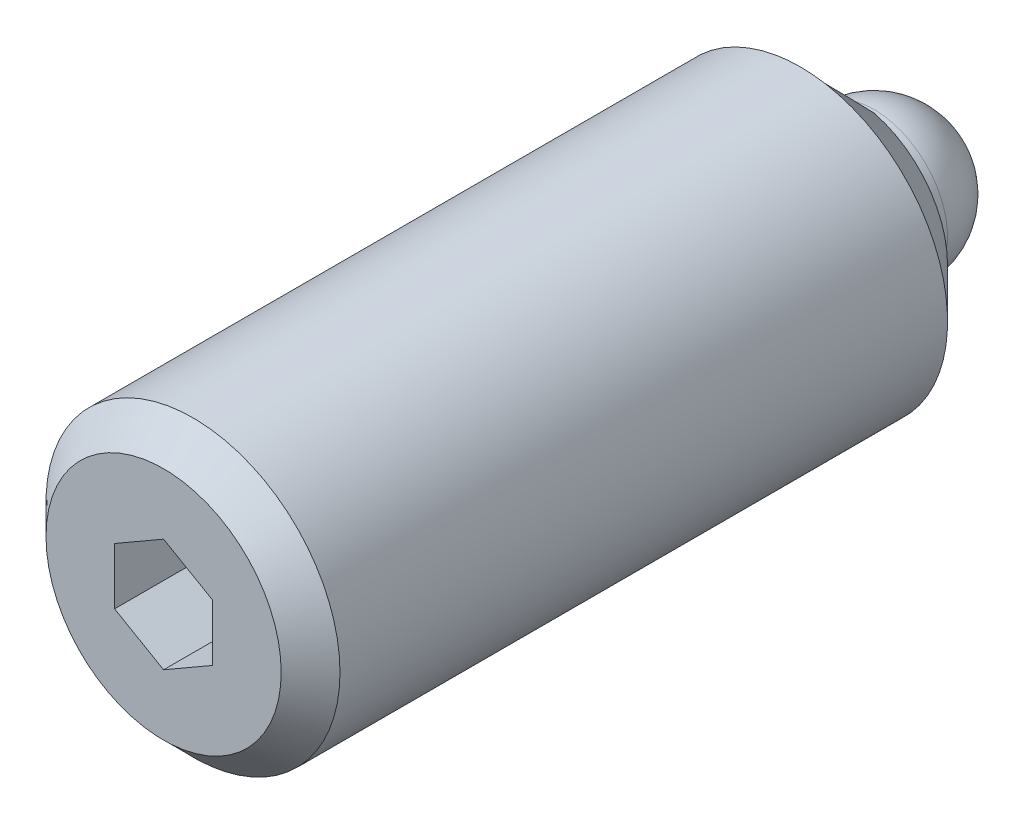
ISO-10303-21;
HEADER;
FILE_DESCRIPTION(('STEP AP214'),'2;1');
FILE_NAME('part.step','',(''),(''),'','','');
FILE_SCHEMA(('AUTOMOTIVE_DESIGN { 1 0 10303 214 1 1 1 1 }'));
ENDSEC;
DATA;
#1=APPLICATION_CONTEXT('core data for automotive mechanical design processes');
#2=APPLICATION_PROTOCOL_DEFINITION('international standard','automotive_design',2000,#1);
#3=PRODUCT_CONTEXT('',#1,'mechanical');
#4=PRODUCT('Part','Part','',(#3));
#5=PRODUCT_RELATED_PRODUCT_CATEGORY('part','',(#4));
#6=PRODUCT_DEFINITION_FORMATION('','',#4);
#7=PRODUCT_DEFINITION_CONTEXT('part definition',#1,'design');
#8=PRODUCT_DEFINITION('design','',#6,#7);
#9=PRODUCT_DEFINITION_SHAPE('','',#8);
#10=(LENGTH_UNIT() NAMED_UNIT(*) SI_UNIT(.MILLI.,.METRE.));
#11=(NAMED_UNIT(*) PLANE_ANGLE_UNIT() SI_UNIT($,.RADIAN.));
#12=(NAMED_UNIT(*) SI_UNIT($,.STERADIAN.) SOLID_ANGLE_UNIT());
#13=UNCERTAINTY_MEASURE_WITH_UNIT(LENGTH_MEASURE(1.E-05),#10,'distance_accuracy_value','');
#14=(GEOMETRIC_REPRESENTATION_CONTEXT(3) GLOBAL_UNCERTAINTY_ASSIGNED_CONTEXT((#13)) GLOBAL_UNIT_ASSIGNED_CONTEXT((#10,
#11,#12)) REPRESENTATION_CONTEXT('',''));
#15=CARTESIAN_POINT('',(0.,0.,0.));
#16=DIRECTION('',(0.,0.,1.));
#17=DIRECTION('',(1.,0.,0.));
#18=AXIS2_PLACEMENT_3D('',#15,#16,#17);
#19=CARTESIAN_POINT('',(0.,3.,4.));
#20=DIRECTION('',(0.,0.,-1.));
#21=DIRECTION('',(-1.,0.,0.));
#22=AXIS2_PLACEMENT_3D('',#19,#20,#21);
#23=PLANE('',#22);
#24=DIRECTION('',(0.,-1.,0.));
#25=VECTOR('',#24,1.);
#26=CARTESIAN_POINT('',(1.,-2.82842712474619,4.));
#27=LINE('',#26,#25);
#28=CARTESIAN_POINT('',(1.,-2.82842712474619,4.));
#29=VERTEX_POINT('',#28);
#30=CARTESIAN_POINT('',(1.,-3.87298334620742,4.));
#31=VERTEX_POINT('',#30);
#32=EDGE_CURVE('E130',#29,#31,#27,.T.);
#33=ORIENTED_EDGE('',*,*,#32,.F.);
#34=CARTESIAN_POINT('',(0.,0.,4.));
#35=DIRECTION('',(0.,0.,-1.));
#36=DIRECTION('',(-1.,0.,0.));
#37=AXIS2_PLACEMENT_3D('',#34,#35,#36);
#38=CIRCLE('',#37,3.);
#39=CARTESIAN_POINT('',(1.,2.82842712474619,4.));
#40=VERTEX_POINT('',#39);
#41=EDGE_CURVE('E219',#40,#29,#38,.T.);
#42=ORIENTED_EDGE('',*,*,#41,.F.);
#43=DIRECTION('',(0.,-1.,0.));
#44=VECTOR('',#43,1.);
#45=CARTESIAN_POINT('',(1.,6.70307128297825,4.));
#46=LINE('',#45,#44);
#47=CARTESIAN_POINT('',(1.,3.87298334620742,4.));
#48=VERTEX_POINT('',#47);
#49=EDGE_CURVE('E149',#48,#40,#46,.T.);
#50=ORIENTED_EDGE('',*,*,#49,.F.);
#51=CARTESIAN_POINT('',(0.,0.,4.));
#52=DIRECTION('',(0.,0.,-1.));
#53=DIRECTION('',(-1.,0.,0.));
#54=AXIS2_PLACEMENT_3D('',#51,#52,#53);
#55=CIRCLE('',#54,4.);
#56=EDGE_CURVE('E228',#48,#31,#55,.T.);
#57=ORIENTED_EDGE('',*,*,#56,.T.);
#58=EDGE_LOOP('',(#33,#42,#50,#57));
#59=FACE_BOUND('',#58,.T.);
#60=ADVANCED_FACE('F14',(#59),#23,.T.);
#61=CARTESIAN_POINT('',(0.,0.,4.));
#62=DIRECTION('',(0.,0.,1.));
#63=DIRECTION('',(1.,0.,0.));
#64=AXIS2_PLACEMENT_3D('',#61,#62,#63);
#65=CONICAL_SURFACE('',#64,4.,0.785398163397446);
#66=CARTESIAN_POINT('',(1.,-0.427561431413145,1.08757012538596));
#67=CARTESIAN_POINT('',(1.,-0.463159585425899,1.10158096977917));
#68=CARTESIAN_POINT('',(1.,-0.498236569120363,1.11683331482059));
#69=CARTESIAN_POINT('',(1.,-0.56739928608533,1.14934845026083));
#70=CARTESIAN_POINT('',(1.,-0.601486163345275,1.16660879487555));
#71=CARTESIAN_POINT('',(1.,-0.668663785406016,1.20262755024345));
#72=CARTESIAN_POINT('',(1.,-0.701758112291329,1.22137936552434));
#73=CARTESIAN_POINT('',(1.,-0.76721913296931,1.26013109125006));
#74=CARTESIAN_POINT('',(1.,-0.799585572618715,1.28013142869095));
#75=CARTESIAN_POINT('',(1.,-0.895406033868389,1.34139261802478));
#76=CARTESIAN_POINT('',(1.,-0.957929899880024,1.38410765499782));
#77=CARTESIAN_POINT('',(1.,-1.05037024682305,1.45011006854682));
#78=CARTESIAN_POINT('',(1.,-1.08098012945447,1.4724486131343));
#79=CARTESIAN_POINT('',(1.,-1.14180285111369,1.51766245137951));
#80=CARTESIAN_POINT('',(1.,-1.172015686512,1.54053774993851));
#81=CARTESIAN_POINT('',(1.,-1.27813818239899,1.62211486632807));
#82=CARTESIAN_POINT('',(1.,-1.35313306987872,1.68200522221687));
#83=CARTESIAN_POINT('',(1.,-1.50162073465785,1.80362517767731));
#84=CARTESIAN_POINT('',(1.,-1.57511327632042,1.86535506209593));
#85=CARTESIAN_POINT('',(1.,-1.7210401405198,1.99011214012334));
#86=CARTESIAN_POINT('',(1.,-1.79347400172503,2.0531398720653));
#87=CARTESIAN_POINT('',(1.,-1.93753461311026,2.18011245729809));
#88=CARTESIAN_POINT('',(1.,-2.00916133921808,2.24405733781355));
#89=CARTESIAN_POINT('',(1.,-2.22321817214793,2.4369724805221));
#90=CARTESIAN_POINT('',(1.,-2.36473987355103,2.56694943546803));
#91=CARTESIAN_POINT('',(1.,-2.64627480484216,2.82844379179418));
#92=CARTESIAN_POINT('',(1.,-2.78628842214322,2.9599607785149));
#93=CARTESIAN_POINT('',(1.,-3.06699939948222,3.22558511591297));
#94=CARTESIAN_POINT('',(1.,-3.20768518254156,3.35970469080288));
#95=CARTESIAN_POINT('',(1.,-3.48838240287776,3.62866572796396));
#96=CARTESIAN_POINT('',(1.,-3.62839379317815,3.76350723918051));
#97=CARTESIAN_POINT('',(1.,-4.04754873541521,4.16862658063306));
#98=CARTESIAN_POINT('',(1.,-4.32597125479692,4.43964995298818));
#99=CARTESIAN_POINT('',(1.,-4.93550354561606,5.03530696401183));
#100=CARTESIAN_POINT('',(1.,-5.26638800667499,5.36017062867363));
#101=CARTESIAN_POINT('',(1.,-5.92735441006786,6.01083940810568));
#102=CARTESIAN_POINT('',(1.,-6.25743618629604,6.3366446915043));
#103=CARTESIAN_POINT('',(1.,-6.91168885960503,6.98348496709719));
#104=CARTESIAN_POINT('',(1.,-7.23586843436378,7.3045111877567));
#105=CARTESIAN_POINT('',(1.,-7.88380258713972,7.94686421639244));
#106=CARTESIAN_POINT('',(1.,-8.20755723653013,8.26819095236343));
#107=CARTESIAN_POINT('',(1.,-8.53121078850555,8.58961917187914));
#108=B_SPLINE_CURVE_WITH_KNOTS('',3,(#66,#67,#68,#69,#70,#71,#72,#73,#74,#75,#76,#77,#78,#79,
#80,#81,#82,#83,#84,#85,#86,#87,#88,#89,#90,#91,#92,#93,#94,#95,#96,#97,#98,#99,#100,#101,#102,
#103,#104,#105,#106,#107),.UNSPECIFIED.,.F.,.F.,(4,2,2,2,2,2,2,2,2,2,2,2,2,2,2,2,2,2,2,2,4),(0.,
0.114701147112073,0.229264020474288,0.343345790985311,0.45746679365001,0.684514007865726,
0.798194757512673,0.911876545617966,1.19974807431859,1.48766441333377,1.77570268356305,
2.06374952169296,2.64018098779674,3.21646066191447,3.79957324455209,4.3827258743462,
5.54837562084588,6.93948388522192,8.33085897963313,9.69956320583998,11.0679967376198),.UNSPECIFIED.);
#109=CARTESIAN_POINT('',(1.,-5.91607978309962,6.));
#110=VERTEX_POINT('',#109);
#111=EDGE_CURVE('E9',#31,#110,#108,.T.);
#112=ORIENTED_EDGE('',*,*,#111,.F.);
#113=ORIENTED_EDGE('',*,*,#56,.F.);
#114=CARTESIAN_POINT('',(1.,7.798755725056,7.86260712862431));
#115=CARTESIAN_POINT('',(1.,7.49960304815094,7.56591254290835));
#116=CARTESIAN_POINT('',(1.,7.20033884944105,7.26932990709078));
#117=CARTESIAN_POINT('',(1.,6.60141682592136,6.67658202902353));
#118=CARTESIAN_POINT('',(1.,6.30175901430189,6.3804167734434));
#119=CARTESIAN_POINT('',(1.,5.70192860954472,5.78874575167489));
#120=CARTESIAN_POINT('',(0.999999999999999,5.40175615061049,5.49323984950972));
#121=CARTESIAN_POINT('',(1.,4.80046522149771,4.90316918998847));
#122=CARTESIAN_POINT('',(1.,4.49934671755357,4.60860446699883));
#123=CARTESIAN_POINT('',(1.,3.97887748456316,4.10230350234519));
#124=CARTESIAN_POINT('',(1.,3.75991823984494,3.89016556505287));
#125=CARTESIAN_POINT('',(0.999999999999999,3.43041876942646,3.57307935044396));
#126=CARTESIAN_POINT('',(0.999999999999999,3.32041364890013,3.46757528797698));
#127=CARTESIAN_POINT('',(0.999999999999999,3.09992582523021,3.25706291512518));
#128=CARTESIAN_POINT('',(0.999999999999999,2.98944311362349,3.15205461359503));
#129=CARTESIAN_POINT('',(0.999999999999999,2.76780288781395,2.94268750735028));
#130=CARTESIAN_POINT('',(0.999999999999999,2.65664518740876,2.83832889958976));
#131=CARTESIAN_POINT('',(0.999999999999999,2.43343761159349,2.63057801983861));
#132=CARTESIAN_POINT('',(0.999999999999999,2.32138778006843,2.52718570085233));
#133=CARTESIAN_POINT('',(0.999999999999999,2.15231048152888,2.37316366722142));
#134=CARTESIAN_POINT('',(0.999999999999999,2.09577583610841,2.32199322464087));
#135=CARTESIAN_POINT('',(0.999999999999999,1.98229835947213,2.22010861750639));
#136=CARTESIAN_POINT('',(0.999999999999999,1.92535553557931,2.16939444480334));
#137=CARTESIAN_POINT('',(0.999999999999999,1.81095393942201,2.0685305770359));
#138=CARTESIAN_POINT('',(0.999999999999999,1.75349508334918,2.01838097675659));
#139=CARTESIAN_POINT('',(0.999999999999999,1.63792010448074,1.91883847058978));
#140=CARTESIAN_POINT('',(0.999999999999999,1.57980394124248,1.86944561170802));
#141=CARTESIAN_POINT('',(1.,1.52128735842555,1.82052608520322));
#142=B_SPLINE_CURVE_WITH_KNOTS('',3,(#114,#115,#116,#117,#118,#119,#120,#121,#122,#123,#124,
#125,#126,#127,#128,#129,#130,#131,#132,#133,#134,#135,#136,#137,#138,#139,#140,#141),
.UNSPECIFIED.,.F.,.F.,(4,2,2,2,2,2,2,2,2,2,2,2,2,4),(0.,1.2639941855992,2.52794704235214,
3.79160928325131,5.05531715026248,5.96992189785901,6.42718453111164,6.88445530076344,
7.34185853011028,7.79923939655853,8.0279976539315,8.25675181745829,8.48554382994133,
8.71434999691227),.UNSPECIFIED.);
#143=CARTESIAN_POINT('',(1.,5.91607978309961,6.));
#144=VERTEX_POINT('',#143);
#145=EDGE_CURVE('E243',#144,#48,#142,.T.);
#146=ORIENTED_EDGE('',*,*,#145,.F.);
#147=CARTESIAN_POINT('',(0.,0.,6.));
#148=DIRECTION('',(0.,0.,-1.));
#149=DIRECTION('',(-1.,0.,0.));
#150=AXIS2_PLACEMENT_3D('',#147,#148,#149);
#151=CIRCLE('',#150,6.);
#152=EDGE_CURVE('E231',#110,#144,#151,.F.);
#153=ORIENTED_EDGE('',*,*,#152,.F.);
#154=EDGE_LOOP('',(#112,#113,#146,#153));
#155=FACE_BOUND('',#154,.T.);
#156=ADVANCED_FACE('F304',(#155),#65,.T.);
#157=CARTESIAN_POINT('',(0.,6.,32.));
#158=DIRECTION('',(0.,0.,1.));
#159=DIRECTION('',(1.,0.,0.));
#160=AXIS2_PLACEMENT_3D('',#157,#158,#159);
#161=PLANE('',#160);
#162=CARTESIAN_POINT('',(0.,0.,32.));
#163=DIRECTION('',(0.,0.,1.));
#164=DIRECTION('',(1.,0.,0.));
#165=AXIS2_PLACEMENT_3D('',#162,#163,#164);
#166=CIRCLE('',#165,4.8);
#167=CARTESIAN_POINT('',(4.8,0.,32.));
#168=VERTEX_POINT('',#167);
#169=EDGE_CURVE('E224',#168,#168,#166,.T.);
#170=ORIENTED_EDGE('',*,*,#169,.T.);
#171=EDGE_LOOP('',(#170));
#172=FACE_BOUND('',#171,.T.);
#173=DIRECTION('',(0.866025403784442,-0.499999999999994,0.));
#174=VECTOR('',#173,1.);
#175=CARTESIAN_POINT('',(-2.,-1.15470053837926,32.));
#176=LINE('',#175,#174);
#177=CARTESIAN_POINT('',(-2.,-1.15470053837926,32.));
#178=VERTEX_POINT('',#177);
#179=CARTESIAN_POINT('',(0.,-2.30940107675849,32.));
#180=VERTEX_POINT('',#179);
#181=EDGE_CURVE('E181',#178,#180,#176,.T.);
#182=ORIENTED_EDGE('',*,*,#181,.F.);
#183=DIRECTION('',(0.,1.,0.));
#184=VECTOR('',#183,1.);
#185=CARTESIAN_POINT('',(-2.,-1.15470053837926,32.));
#186=LINE('',#185,#184);
#187=CARTESIAN_POINT('',(-2.,1.15470053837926,32.));
#188=VERTEX_POINT('',#187);
#189=EDGE_CURVE('E164',#178,#188,#186,.T.);
#190=ORIENTED_EDGE('',*,*,#189,.T.);
#191=DIRECTION('',(0.866025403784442,0.499999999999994,0.));
#192=VECTOR('',#191,1.);
#193=CARTESIAN_POINT('',(-2.,1.15470053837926,32.));
#194=LINE('',#193,#192);
#195=CARTESIAN_POINT('',(0.,2.30940107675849,32.));
#196=VERTEX_POINT('',#195);
#197=EDGE_CURVE('E169',#188,#196,#194,.T.);
#198=ORIENTED_EDGE('',*,*,#197,.T.);
#199=DIRECTION('',(-0.866025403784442,0.499999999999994,0.));
#200=VECTOR('',#199,1.);
#201=CARTESIAN_POINT('',(2.,1.15470053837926,32.));
#202=LINE('',#201,#200);
#203=CARTESIAN_POINT('',(2.,1.15470053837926,32.));
#204=VERTEX_POINT('',#203);
#205=EDGE_CURVE('E172',#204,#196,#202,.T.);
#206=ORIENTED_EDGE('',*,*,#205,.F.);
#207=DIRECTION('',(0.,1.,0.));
#208=VECTOR('',#207,1.);
#209=CARTESIAN_POINT('',(2.,-1.15470053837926,32.));
#210=LINE('',#209,#208);
#211=CARTESIAN_POINT('',(2.,-1.15470053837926,32.));
#212=VERTEX_POINT('',#211);
#213=EDGE_CURVE('E175',#212,#204,#210,.T.);
#214=ORIENTED_EDGE('',*,*,#213,.F.);
#215=DIRECTION('',(-0.866025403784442,-0.499999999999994,0.));
#216=VECTOR('',#215,1.);
#217=CARTESIAN_POINT('',(2.,-1.15470053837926,32.));
#218=LINE('',#217,#216);
#219=EDGE_CURVE('E178',#212,#180,#218,.T.);
#220=ORIENTED_EDGE('',*,*,#219,.T.);
#221=EDGE_LOOP('',(#182,#190,#198,#206,#214,#220));
#222=FACE_BOUND('',#221,.T.);
#223=ADVANCED_FACE('F301',(#172,#222),#161,.T.);
#224=CARTESIAN_POINT('',(0.,0.,3.));
#225=DIRECTION('',(-1.,0.,0.));
#226=DIRECTION('',(0.,0.,1.));
#227=AXIS2_PLACEMENT_3D('',#224,#225,#226);
#228=SPHERICAL_SURFACE('',#227,3.);
#229=CARTESIAN_POINT('',(0.,0.,3.));
#230=DIRECTION('',(0.,0.,-1.));
#231=DIRECTION('',(-1.,0.,0.));
#232=AXIS2_PLACEMENT_3D('',#229,#230,#231);
#233=SPHERICAL_SURFACE('',#232,3.);
#234=CARTESIAN_POINT('',(0.,0.,3.));
#235=DIRECTION('',(0.,0.,-1.));
#236=DIRECTION('',(-1.,0.,0.));
#237=AXIS2_PLACEMENT_3D('',#234,#235,#236);
#238=CIRCLE('',#237,3.);
#239=CARTESIAN_POINT('',(-3.,0.,3.));
#240=VERTEX_POINT('',#239);
#241=EDGE_CURVE('E215',#240,#240,#238,.T.);
#242=ORIENTED_EDGE('',*,*,#241,.T.);
#243=EDGE_LOOP('',(#242));
#244=FACE_BOUND('',#243,.T.);
#245=ADVANCED_FACE('F299',(#244),#233,.T.);
#246=CARTESIAN_POINT('',(0.,0.,-5.));
#247=DIRECTION('',(0.,0.,-1.));
#248=DIRECTION('',(-1.,0.,0.));
#249=AXIS2_PLACEMENT_3D('',#246,#247,#248);
#250=CYLINDRICAL_SURFACE('',#249,6.);
#251=CARTESIAN_POINT('',(-1.,5.91607978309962,6.));
#252=VERTEX_POINT('',#251);
#253=EDGE_CURVE('E232',#144,#252,#151,.F.);
#254=ORIENTED_EDGE('',*,*,#253,.T.);
#255=CARTESIAN_POINT('',(-1.,-5.91607978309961,6.));
#256=VERTEX_POINT('',#255);
#257=EDGE_CURVE('E236',#252,#256,#151,.F.);
#258=ORIENTED_EDGE('',*,*,#257,.T.);
#259=EDGE_CURVE('E127',#256,#110,#151,.F.);
#260=ORIENTED_EDGE('',*,*,#259,.T.);
#261=ORIENTED_EDGE('',*,*,#152,.T.);
#262=EDGE_LOOP('',(#254,#258,#260,#261));
#263=FACE_BOUND('',#262,.T.);
#264=CARTESIAN_POINT('',(0.,0.,30.8));
#265=DIRECTION('',(0.,0.,1.));
#266=DIRECTION('',(1.,0.,0.));
#267=AXIS2_PLACEMENT_3D('',#264,#265,#266);
#268=CIRCLE('',#267,6.);
#269=CARTESIAN_POINT('',(6.,0.,30.8));
#270=VERTEX_POINT('',#269);
#271=EDGE_CURVE('E221',#270,#270,#268,.F.);
#272=ORIENTED_EDGE('',*,*,#271,.T.);
#273=EDGE_LOOP('',(#272));
#274=FACE_BOUND('',#273,.T.);
#275=ADVANCED_FACE('F295',(#263,#274),#250,.T.);
#276=DIRECTION('',(0.,1.,0.));
#277=VECTOR('',#276,1.);
#278=CARTESIAN_POINT('',(-1.,-2.82842712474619,4.));
#279=LINE('',#278,#277);
#280=CARTESIAN_POINT('',(-1.,-3.87298334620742,4.));
#281=VERTEX_POINT('',#280);
#282=CARTESIAN_POINT('',(-1.,-2.82842712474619,4.));
#283=VERTEX_POINT('',#282);
#284=EDGE_CURVE('E136',#281,#283,#279,.T.);
#285=ORIENTED_EDGE('',*,*,#284,.F.);
#286=CARTESIAN_POINT('',(-1.,3.87298334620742,4.));
#287=VERTEX_POINT('',#286);
#288=EDGE_CURVE('E227',#281,#287,#55,.T.);
#289=ORIENTED_EDGE('',*,*,#288,.T.);
#290=DIRECTION('',(0.,1.,0.));
#291=VECTOR('',#290,1.);
#292=CARTESIAN_POINT('',(-1.,6.70307128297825,4.));
#293=LINE('',#292,#291);
#294=CARTESIAN_POINT('',(-1.,2.82842712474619,4.));
#295=VERTEX_POINT('',#294);
#296=EDGE_CURVE('E154',#295,#287,#293,.T.);
#297=ORIENTED_EDGE('',*,*,#296,.F.);
#298=EDGE_CURVE('E218',#283,#295,#38,.T.);
#299=ORIENTED_EDGE('',*,*,#298,.F.);
#300=EDGE_LOOP('',(#285,#289,#297,#299));
#301=FACE_BOUND('',#300,.T.);
#302=ADVANCED_FACE('F292',(#301),#23,.T.);
#303=CARTESIAN_POINT('',(0.,0.,-5.));
#304=DIRECTION('',(0.,0.,-1.));
#305=DIRECTION('',(-1.,0.,0.));
#306=AXIS2_PLACEMENT_3D('',#303,#304,#305);
#307=CYLINDRICAL_SURFACE('',#306,3.);
#308=ORIENTED_EDGE('',*,*,#41,.T.);
#309=DIRECTION('',(0.,0.,-1.));
#310=VECTOR('',#309,1.);
#311=CARTESIAN_POINT('',(1.,-2.82842712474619,6.));
#312=LINE('',#311,#310);
#313=CARTESIAN_POINT('',(1.,-2.82842712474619,6.));
#314=VERTEX_POINT('',#313);
#315=EDGE_CURVE('E139',#314,#29,#312,.T.);
#316=ORIENTED_EDGE('',*,*,#315,.F.);
#317=CARTESIAN_POINT('',(0.,0.,6.));
#318=DIRECTION('',(0.,0.,1.));
#319=DIRECTION('',(-1.,0.,0.));
#320=AXIS2_PLACEMENT_3D('',#317,#318,#319);
#321=CIRCLE('',#320,3.);
#322=CARTESIAN_POINT('',(-1.,-2.82842712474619,6.));
#323=VERTEX_POINT('',#322);
#324=EDGE_CURVE('E125',#323,#314,#321,.T.);
#325=ORIENTED_EDGE('',*,*,#324,.F.);
#326=DIRECTION('',(0.,0.,-1.));
#327=VECTOR('',#326,1.);
#328=CARTESIAN_POINT('',(-1.,-2.82842712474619,6.));
#329=LINE('',#328,#327);
#330=EDGE_CURVE('E133',#323,#283,#329,.T.);
#331=ORIENTED_EDGE('',*,*,#330,.T.);
#332=ORIENTED_EDGE('',*,*,#298,.T.);
#333=DIRECTION('',(0.,0.,-1.));
#334=VECTOR('',#333,1.);
#335=CARTESIAN_POINT('',(-1.,2.82842712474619,6.));
#336=LINE('',#335,#334);
#337=CARTESIAN_POINT('',(-1.,2.82842712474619,6.));
#338=VERTEX_POINT('',#337);
#339=EDGE_CURVE('E161',#338,#295,#336,.T.);
#340=ORIENTED_EDGE('',*,*,#339,.F.);
#341=CARTESIAN_POINT('',(0.,0.,6.));
#342=DIRECTION('',(0.,0.,1.));
#343=DIRECTION('',(-1.,0.,0.));
#344=AXIS2_PLACEMENT_3D('',#341,#342,#343);
#345=CIRCLE('',#344,3.);
#346=CARTESIAN_POINT('',(1.,2.82842712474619,6.));
#347=VERTEX_POINT('',#346);
#348=EDGE_CURVE('E153',#347,#338,#345,.T.);
#349=ORIENTED_EDGE('',*,*,#348,.F.);
#350=DIRECTION('',(0.,0.,-1.));
#351=VECTOR('',#350,1.);
#352=CARTESIAN_POINT('',(1.,2.82842712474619,6.));
#353=LINE('',#352,#351);
#354=EDGE_CURVE('E157',#347,#40,#353,.T.);
#355=ORIENTED_EDGE('',*,*,#354,.T.);
#356=EDGE_LOOP('',(#308,#316,#325,#331,#332,#340,#349,#355));
#357=FACE_BOUND('',#356,.T.);
#358=ORIENTED_EDGE('',*,*,#241,.F.);
#359=EDGE_LOOP('',(#358));
#360=FACE_BOUND('',#359,.T.);
#361=ADVANCED_FACE('F142',(#357,#360),#307,.T.);
#362=CARTESIAN_POINT('',(-2.,-1.15470053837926,27.));
#363=DIRECTION('',(1.,0.,0.));
#364=DIRECTION('',(0.,0.,-1.));
#365=AXIS2_PLACEMENT_3D('',#362,#363,#364);
#366=PLANE('',#365);
#367=DIRECTION('',(0.,0.,1.));
#368=VECTOR('',#367,1.);
#369=CARTESIAN_POINT('',(-2.,1.15470053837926,27.));
#370=LINE('',#369,#368);
#371=CARTESIAN_POINT('',(-2.,1.15470053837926,27.));
#372=VERTEX_POINT('',#371);
#373=EDGE_CURVE('E213',#372,#188,#370,.T.);
#374=ORIENTED_EDGE('',*,*,#373,.T.);
#375=ORIENTED_EDGE('',*,*,#189,.F.);
#376=DIRECTION('',(0.,0.,1.));
#377=VECTOR('',#376,1.);
#378=CARTESIAN_POINT('',(-2.,-1.15470053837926,27.));
#379=LINE('',#378,#377);
#380=CARTESIAN_POINT('',(-2.,-1.15470053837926,27.));
#381=VERTEX_POINT('',#380);
#382=EDGE_CURVE('E202',#381,#178,#379,.T.);
#383=ORIENTED_EDGE('',*,*,#382,.F.);
#384=DIRECTION('',(0.,1.,0.));
#385=VECTOR('',#384,1.);
#386=CARTESIAN_POINT('',(-2.,-1.15470053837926,27.));
#387=LINE('',#386,#385);
#388=EDGE_CURVE('E184',#381,#372,#387,.T.);
#389=ORIENTED_EDGE('',*,*,#388,.T.);
#390=EDGE_LOOP('',(#374,#375,#383,#389));
#391=FACE_BOUND('',#390,.T.);
#392=ADVANCED_FACE('F268',(#391),#366,.T.);
#393=CARTESIAN_POINT('',(-2.,1.15470053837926,27.));
#394=DIRECTION('',(0.499999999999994,-0.866025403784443,0.));
#395=DIRECTION('',(0.866025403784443,0.499999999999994,0.));
#396=AXIS2_PLACEMENT_3D('',#393,#394,#395);
#397=PLANE('',#396);
#398=DIRECTION('',(0.,0.,1.));
#399=VECTOR('',#398,1.);
#400=CARTESIAN_POINT('',(0.,2.30940107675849,27.));
#401=LINE('',#400,#399);
#402=CARTESIAN_POINT('',(0.,2.30940107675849,27.));
#403=VERTEX_POINT('',#402);
#404=EDGE_CURVE('E211',#403,#196,#401,.T.);
#405=ORIENTED_EDGE('',*,*,#404,.T.);
#406=ORIENTED_EDGE('',*,*,#197,.F.);
#407=ORIENTED_EDGE('',*,*,#373,.F.);
#408=DIRECTION('',(0.866025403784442,0.499999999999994,0.));
#409=VECTOR('',#408,1.);
#410=CARTESIAN_POINT('',(-2.,1.15470053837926,27.));
#411=LINE('',#410,#409);
#412=EDGE_CURVE('E187',#372,#403,#411,.T.);
#413=ORIENTED_EDGE('',*,*,#412,.T.);
#414=EDGE_LOOP('',(#405,#406,#407,#413));
#415=FACE_BOUND('',#414,.T.);
#416=ADVANCED_FACE('F271',(#415),#397,.T.);
#417=CARTESIAN_POINT('',(2.,1.15470053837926,27.));
#418=DIRECTION('',(0.499999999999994,0.866025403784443,0.));
#419=DIRECTION('',(-0.866025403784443,0.499999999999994,0.));
#420=AXIS2_PLACEMENT_3D('',#417,#418,#419);
#421=PLANE('',#420);
#422=DIRECTION('',(0.,0.,1.));
#423=VECTOR('',#422,1.);
#424=CARTESIAN_POINT('',(2.,1.15470053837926,27.));
#425=LINE('',#424,#423);
#426=CARTESIAN_POINT('',(2.,1.15470053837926,27.));
#427=VERTEX_POINT('',#426);
#428=EDGE_CURVE('E209',#427,#204,#425,.T.);
#429=ORIENTED_EDGE('',*,*,#428,.T.);
#430=ORIENTED_EDGE('',*,*,#205,.T.);
#431=ORIENTED_EDGE('',*,*,#404,.F.);
#432=DIRECTION('',(-0.866025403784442,0.499999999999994,0.));
#433=VECTOR('',#432,1.);
#434=CARTESIAN_POINT('',(2.,1.15470053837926,27.));
#435=LINE('',#434,#433);
#436=EDGE_CURVE('E190',#427,#403,#435,.T.);
#437=ORIENTED_EDGE('',*,*,#436,.F.);
#438=EDGE_LOOP('',(#429,#430,#431,#437));
#439=FACE_BOUND('',#438,.T.);
#440=ADVANCED_FACE('F282',(#439),#421,.F.);
#441=CARTESIAN_POINT('',(2.,-1.15470053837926,27.));
#442=DIRECTION('',(1.,0.,0.));
#443=DIRECTION('',(0.,0.,-1.));
#444=AXIS2_PLACEMENT_3D('',#441,#442,#443);
#445=PLANE('',#444);
#446=DIRECTION('',(0.,0.,1.));
#447=VECTOR('',#446,1.);
#448=CARTESIAN_POINT('',(2.,-1.15470053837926,27.));
#449=LINE('',#448,#447);
#450=CARTESIAN_POINT('',(2.,-1.15470053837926,27.));
#451=VERTEX_POINT('',#450);
#452=EDGE_CURVE('E207',#451,#212,#449,.T.);
#453=ORIENTED_EDGE('',*,*,#452,.T.);
#454=ORIENTED_EDGE('',*,*,#213,.T.);
#455=ORIENTED_EDGE('',*,*,#428,.F.);
#456=DIRECTION('',(0.,1.,0.));
#457=VECTOR('',#456,1.);
#458=CARTESIAN_POINT('',(2.,-1.15470053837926,27.));
#459=LINE('',#458,#457);
#460=EDGE_CURVE('E193',#451,#427,#459,.T.);
#461=ORIENTED_EDGE('',*,*,#460,.F.);
#462=EDGE_LOOP('',(#453,#454,#455,#461));
#463=FACE_BOUND('',#462,.T.);
#464=ADVANCED_FACE('F278',(#463),#445,.F.);
#465=CARTESIAN_POINT('',(2.,-1.15470053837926,27.));
#466=DIRECTION('',(-0.499999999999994,0.866025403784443,0.));
#467=DIRECTION('',(-0.866025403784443,-0.499999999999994,0.));
#468=AXIS2_PLACEMENT_3D('',#465,#466,#467);
#469=PLANE('',#468);
#470=DIRECTION('',(0.,0.,1.));
#471=VECTOR('',#470,1.);
#472=CARTESIAN_POINT('',(0.,-2.30940107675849,27.));
#473=LINE('',#472,#471);
#474=CARTESIAN_POINT('',(0.,-2.30940107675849,27.));
#475=VERTEX_POINT('',#474);
#476=EDGE_CURVE('E205',#475,#180,#473,.T.);
#477=ORIENTED_EDGE('',*,*,#476,.T.);
#478=ORIENTED_EDGE('',*,*,#219,.F.);
#479=ORIENTED_EDGE('',*,*,#452,.F.);
#480=DIRECTION('',(-0.866025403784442,-0.499999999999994,0.));
#481=VECTOR('',#480,1.);
#482=CARTESIAN_POINT('',(2.,-1.15470053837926,27.));
#483=LINE('',#482,#481);
#484=EDGE_CURVE('E196',#451,#475,#483,.T.);
#485=ORIENTED_EDGE('',*,*,#484,.T.);
#486=EDGE_LOOP('',(#477,#478,#479,#485));
#487=FACE_BOUND('',#486,.T.);
#488=ADVANCED_FACE('F267',(#487),#469,.T.);
#489=CARTESIAN_POINT('',(-2.,-1.15470053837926,27.));
#490=DIRECTION('',(-0.499999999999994,-0.866025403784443,0.));
#491=DIRECTION('',(0.866025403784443,-0.499999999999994,0.));
#492=AXIS2_PLACEMENT_3D('',#489,#490,#491);
#493=PLANE('',#492);
#494=DIRECTION('',(0.866025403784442,-0.499999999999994,0.));
#495=VECTOR('',#494,1.);
#496=CARTESIAN_POINT('',(-2.,-1.15470053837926,27.));
#497=LINE('',#496,#495);
#498=EDGE_CURVE('E199',#381,#475,#497,.T.);
#499=ORIENTED_EDGE('',*,*,#498,.F.);
#500=ORIENTED_EDGE('',*,*,#382,.T.);
#501=ORIENTED_EDGE('',*,*,#181,.T.);
#502=ORIENTED_EDGE('',*,*,#476,.F.);
#503=EDGE_LOOP('',(#499,#500,#501,#502));
#504=FACE_BOUND('',#503,.T.);
#505=ADVANCED_FACE('F265',(#504),#493,.F.);
#506=CARTESIAN_POINT('',(-2.,1.15470053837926,27.));
#507=DIRECTION('',(0.,0.,-1.));
#508=DIRECTION('',(-1.,0.,0.));
#509=AXIS2_PLACEMENT_3D('',#506,#507,#508);
#510=PLANE('',#509);
#511=ORIENTED_EDGE('',*,*,#388,.F.);
#512=ORIENTED_EDGE('',*,*,#498,.T.);
#513=ORIENTED_EDGE('',*,*,#484,.F.);
#514=ORIENTED_EDGE('',*,*,#460,.T.);
#515=ORIENTED_EDGE('',*,*,#436,.T.);
#516=ORIENTED_EDGE('',*,*,#412,.F.);
#517=EDGE_LOOP('',(#511,#512,#513,#514,#515,#516));
#518=FACE_BOUND('',#517,.T.);
#519=ADVANCED_FACE('F261',(#518),#510,.F.);
#520=CARTESIAN_POINT('',(0.,0.,30.8));
#521=DIRECTION('',(0.,0.,-1.));
#522=DIRECTION('',(-1.,0.,0.));
#523=AXIS2_PLACEMENT_3D('',#520,#521,#522);
#524=CONICAL_SURFACE('',#523,6.,0.78539816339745);
#525=ORIENTED_EDGE('',*,*,#169,.F.);
#526=EDGE_LOOP('',(#525));
#527=FACE_BOUND('',#526,.T.);
#528=ORIENTED_EDGE('',*,*,#271,.F.);
#529=EDGE_LOOP('',(#528));
#530=FACE_BOUND('',#529,.T.);
#531=ADVANCED_FACE('F264',(#527,#530),#524,.T.);
#532=CARTESIAN_POINT('',(-1.,-8.53121078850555,8.58961917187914));
#533=CARTESIAN_POINT('',(-1.,-8.20460828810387,8.26526499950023));
#534=CARTESIAN_POINT('',(-1.,-7.87790474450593,7.94101210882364));
#535=CARTESIAN_POINT('',(-1.,-7.22425390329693,7.29300232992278));
#536=CARTESIAN_POINT('',(-1.,-6.89730674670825,6.96924529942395));
#537=CARTESIAN_POINT('',(-1.,-6.40665522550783,6.48418407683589));
#538=CARTESIAN_POINT('',(-1.,-6.24315162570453,6.3226768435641));
#539=CARTESIAN_POINT('',(-1.,-5.91597510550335,5.99983762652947));
#540=CARTESIAN_POINT('',(-1.,-5.75230218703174,5.83850564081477));
#541=CARTESIAN_POINT('',(-1.,-5.42467977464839,5.51600561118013));
#542=CARTESIAN_POINT('',(-1.,-5.26073020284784,5.35483764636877));
#543=CARTESIAN_POINT('',(-1.,-4.93253861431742,5.03278620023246));
#544=CARTESIAN_POINT('',(-1.,-4.76829658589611,4.8719027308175));
#545=CARTESIAN_POINT('',(-1.,-4.43906851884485,4.55017624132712));
#546=CARTESIAN_POINT('',(-1.,-4.27408163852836,4.38933408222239));
#547=CARTESIAN_POINT('',(-1.,-3.9435982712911,4.06822248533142));
#548=CARTESIAN_POINT('',(-1.,-3.77810186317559,3.90795296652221));
#549=CARTESIAN_POINT('',(-1.,-3.4465269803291,3.58839694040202));
#550=CARTESIAN_POINT('',(-1.,-3.28044938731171,3.42910951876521));
#551=CARTESIAN_POINT('',(-1.,-2.94704707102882,3.11166353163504));
#552=CARTESIAN_POINT('',(-1.,-2.77972173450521,2.95350560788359));
#553=CARTESIAN_POINT('',(-1.,-2.52697142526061,2.71747838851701));
#554=CARTESIAN_POINT('',(-1.,-2.44225706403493,2.63884882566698));
#555=CARTESIAN_POINT('',(-1.,-2.27220108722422,2.48229515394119));
#556=CARTESIAN_POINT('',(-1.,-2.18685956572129,2.40437094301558));
#557=CARTESIAN_POINT('',(-1.,-2.01546401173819,2.24960837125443));
#558=CARTESIAN_POINT('',(-1.,-1.92941147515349,2.17276835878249));
#559=CARTESIAN_POINT('',(-1.,-1.75606229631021,2.02040667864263));
#560=CARTESIAN_POINT('',(-1.,-1.66876500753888,1.94488574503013));
#561=CARTESIAN_POINT('',(-1.,-1.49189586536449,1.79540525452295));
#562=CARTESIAN_POINT('',(-1.,-1.40231326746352,1.7214582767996));
#563=CARTESIAN_POINT('',(-1.,-1.26602105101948,1.61309139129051));
#564=CARTESIAN_POINT('',(-1.,-1.2203071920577,1.57742166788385));
#565=CARTESIAN_POINT('',(-1.,-1.12803070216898,1.50716758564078));
#566=CARTESIAN_POINT('',(-1.,-1.08146785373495,1.4725835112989));
#567=CARTESIAN_POINT('',(-1.,-0.98695968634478,1.40463605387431));
#568=CARTESIAN_POINT('',(-1.,-0.939006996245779,1.37128285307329));
#569=CARTESIAN_POINT('',(-1.,-0.841780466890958,1.30662752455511));
#570=CARTESIAN_POINT('',(-1.,-0.792507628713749,1.27532390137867));
#571=CARTESIAN_POINT('',(-1.,-0.691968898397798,1.21539295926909));
#572=CARTESIAN_POINT('',(-1.,-0.640693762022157,1.18678083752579));
#573=CARTESIAN_POINT('',(-1.,-0.562130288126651,1.14694459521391));
#574=CARTESIAN_POINT('',(-1.,-0.53563259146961,1.13416522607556));
#575=CARTESIAN_POINT('',(-1.,-0.482046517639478,1.10986480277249));
#576=CARTESIAN_POINT('',(-1.,-0.454957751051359,1.09834461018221));
#577=CARTESIAN_POINT('',(-1.,-0.427561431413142,1.08757012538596));
#578=B_SPLINE_CURVE_WITH_KNOTS('',3,(#532,#533,#534,#535,#536,#537,#538,#539,#540,#541,#542,
#543,#544,#545,#546,#547,#548,#549,#550,#551,#552,#553,#554,#555,#556,#557,#558,#559,#560,#561,
#562,#563,#564,#565,#566,#567,#568,#569,#570,#571,#572,#573,#574,#575,#576,#577),.UNSPECIFIED.,
.F.,.F.,(4,2,2,2,2,2,2,2,2,2,2,2,2,2,2,2,2,2,2,2,2,2,4),(0.,1.3808963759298,2.76126459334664,
3.45072958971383,4.14018682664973,4.82989024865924,5.51962189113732,6.21086476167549,
6.90200561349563,7.59235634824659,8.28307227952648,8.62981461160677,8.976505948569,
9.32259481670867,9.66887050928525,10.0172925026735,10.1912308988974,10.3652145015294,
10.5404101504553,10.7154765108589,10.8914784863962,10.9797041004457,11.0679897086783),.UNSPECIFIED.);
#579=EDGE_CURVE('E28',#256,#281,#578,.T.);
#580=ORIENTED_EDGE('',*,*,#579,.F.);
#581=ORIENTED_EDGE('',*,*,#257,.F.);
#582=CARTESIAN_POINT('',(-1.,1.52128735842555,1.82052608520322));
#583=CARTESIAN_POINT('',(-1.,1.58956176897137,1.87761526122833));
#584=CARTESIAN_POINT('',(-1.,1.65729841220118,1.93533815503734));
#585=CARTESIAN_POINT('',(-1.,1.79190977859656,2.0517707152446));
#586=CARTESIAN_POINT('',(-1.,1.85878457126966,2.11048030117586));
#587=CARTESIAN_POINT('',(-1.,1.99188417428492,2.22860367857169));
#588=CARTESIAN_POINT('',(-1.,2.05810910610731,2.28801733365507));
#589=CARTESIAN_POINT('',(-1.,2.19005955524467,2.40739925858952));
#590=CARTESIAN_POINT('',(-1.,2.25578506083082,2.46736754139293));
#591=CARTESIAN_POINT('',(-1.,2.45233366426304,2.64787370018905));
#592=CARTESIAN_POINT('',(-1.,2.58257014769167,2.76904983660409));
#593=CARTESIAN_POINT('',(-1.,2.8420272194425,3.01249464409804));
#594=CARTESIAN_POINT('',(-1.,2.97124775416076,3.13476337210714));
#595=CARTESIAN_POINT('',(-1.,3.19209897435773,3.34495195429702));
#596=CARTESIAN_POINT('',(-1.,3.28390439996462,3.43268838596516));
#597=CARTESIAN_POINT('',(-1.,3.46722602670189,3.60845939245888));
#598=CARTESIAN_POINT('',(-1.,3.5587422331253,3.69649396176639));
#599=CARTESIAN_POINT('',(-1.,3.83296966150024,3.96097374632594));
#600=CARTESIAN_POINT('',(-1.,4.01533802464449,4.13777435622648));
#601=CARTESIAN_POINT('',(-1.,4.49943841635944,4.60868894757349));
#602=CARTESIAN_POINT('',(-1.,4.8006443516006,4.90334312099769));
#603=CARTESIAN_POINT('',(-1.,5.40212341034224,5.49360210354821));
#604=CARTESIAN_POINT('',(-1.,5.70239653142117,5.78920691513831));
#605=CARTESIAN_POINT('',(-1.,6.30223855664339,6.38089019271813));
#606=CARTESIAN_POINT('',(-1.,6.60180769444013,6.67696842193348));
#607=CARTESIAN_POINT('',(-1.,7.20054020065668,7.26952961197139));
#608=CARTESIAN_POINT('',(-1.,7.49970357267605,7.56601256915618));
#609=CARTESIAN_POINT('',(-1.,7.798755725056,7.86260712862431));
#610=B_SPLINE_CURVE_WITH_KNOTS('',3,(#582,#583,#584,#585,#586,#587,#588,#589,#590,#591,#592,
#593,#594,#595,#596,#597,#598,#599,#600,#601,#602,#603,#604,#605,#606,#607,#608,#609),
.UNSPECIFIED.,.F.,.F.,(4,2,2,2,2,2,2,2,2,2,2,2,2,4),(0.,0.266980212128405,0.533938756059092,
0.800846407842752,1.06776030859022,1.60142187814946,2.13511141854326,2.51607421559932,
2.89702999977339,3.65903142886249,4.92311390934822,6.18719966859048,7.45077976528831,
8.71434857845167),.UNSPECIFIED.);
#611=EDGE_CURVE('E235',#287,#252,#610,.T.);
#612=ORIENTED_EDGE('',*,*,#611,.F.);
#613=ORIENTED_EDGE('',*,*,#288,.F.);
#614=EDGE_LOOP('',(#580,#581,#612,#613));
#615=FACE_BOUND('',#614,.T.);
#616=ADVANCED_FACE('F16',(#615),#65,.T.);
#617=CARTESIAN_POINT('',(1.,6.70307128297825,6.));
#618=DIRECTION('',(1.,0.,0.));
#619=DIRECTION('',(0.,1.,0.));
#620=AXIS2_PLACEMENT_3D('',#617,#618,#619);
#621=PLANE('',#620);
#622=ORIENTED_EDGE('',*,*,#145,.T.);
#623=ORIENTED_EDGE('',*,*,#49,.T.);
#624=ORIENTED_EDGE('',*,*,#354,.F.);
#625=DIRECTION('',(0.,-1.,0.));
#626=VECTOR('',#625,1.);
#627=CARTESIAN_POINT('',(1.,6.70307128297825,6.));
#628=LINE('',#627,#626);
#629=EDGE_CURVE('E151',#144,#347,#628,.T.);
#630=ORIENTED_EDGE('',*,*,#629,.F.);
#631=EDGE_LOOP('',(#622,#623,#624,#630));
#632=FACE_BOUND('',#631,.T.);
#633=ADVANCED_FACE('F254',(#632),#621,.F.);
#634=CARTESIAN_POINT('',(-1.,6.70307128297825,6.));
#635=DIRECTION('',(-1.,0.,0.));
#636=DIRECTION('',(0.,0.,1.));
#637=AXIS2_PLACEMENT_3D('',#634,#635,#636);
#638=PLANE('',#637);
#639=ORIENTED_EDGE('',*,*,#611,.T.);
#640=DIRECTION('',(0.,1.,0.));
#641=VECTOR('',#640,1.);
#642=CARTESIAN_POINT('',(-1.,6.70307128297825,6.));
#643=LINE('',#642,#641);
#644=EDGE_CURVE('E42',#338,#252,#643,.T.);
#645=ORIENTED_EDGE('',*,*,#644,.F.);
#646=ORIENTED_EDGE('',*,*,#339,.T.);
#647=ORIENTED_EDGE('',*,*,#296,.T.);
#648=EDGE_LOOP('',(#639,#645,#646,#647));
#649=FACE_BOUND('',#648,.T.);
#650=ADVANCED_FACE('F249',(#649),#638,.F.);
#651=CARTESIAN_POINT('',(0.,0.,6.));
#652=DIRECTION('',(0.,0.,-1.));
#653=DIRECTION('',(-1.,0.,0.));
#654=AXIS2_PLACEMENT_3D('',#651,#652,#653);
#655=PLANE('',#654);
#656=ORIENTED_EDGE('',*,*,#629,.T.);
#657=ORIENTED_EDGE('',*,*,#348,.T.);
#658=ORIENTED_EDGE('',*,*,#644,.T.);
#659=ORIENTED_EDGE('',*,*,#253,.F.);
#660=EDGE_LOOP('',(#656,#657,#658,#659));
#661=FACE_BOUND('',#660,.T.);
#662=ADVANCED_FACE('F253',(#661),#655,.T.);
#663=CARTESIAN_POINT('',(1.,-2.82842712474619,6.));
#664=DIRECTION('',(1.,0.,0.));
#665=DIRECTION('',(0.,1.,0.));
#666=AXIS2_PLACEMENT_3D('',#663,#664,#665);
#667=PLANE('',#666);
#668=ORIENTED_EDGE('',*,*,#111,.T.);
#669=DIRECTION('',(0.,-1.,0.));
#670=VECTOR('',#669,1.);
#671=CARTESIAN_POINT('',(1.,-2.82842712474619,6.));
#672=LINE('',#671,#670);
#673=EDGE_CURVE('E35',#314,#110,#672,.T.);
#674=ORIENTED_EDGE('',*,*,#673,.F.);
#675=ORIENTED_EDGE('',*,*,#315,.T.);
#676=ORIENTED_EDGE('',*,*,#32,.T.);
#677=EDGE_LOOP('',(#668,#674,#675,#676));
#678=FACE_BOUND('',#677,.T.);
#679=ADVANCED_FACE('F336',(#678),#667,.F.);
#680=CARTESIAN_POINT('',(-1.,-2.82842712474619,6.));
#681=DIRECTION('',(-1.,0.,0.));
#682=DIRECTION('',(0.,-1.,0.));
#683=AXIS2_PLACEMENT_3D('',#680,#681,#682);
#684=PLANE('',#683);
#685=ORIENTED_EDGE('',*,*,#579,.T.);
#686=ORIENTED_EDGE('',*,*,#284,.T.);
#687=ORIENTED_EDGE('',*,*,#330,.F.);
#688=DIRECTION('',(0.,1.,0.));
#689=VECTOR('',#688,1.);
#690=CARTESIAN_POINT('',(-1.,-2.82842712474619,6.));
#691=LINE('',#690,#689);
#692=EDGE_CURVE('E121',#256,#323,#691,.T.);
#693=ORIENTED_EDGE('',*,*,#692,.F.);
#694=EDGE_LOOP('',(#685,#686,#687,#693));
#695=FACE_BOUND('',#694,.T.);
#696=ADVANCED_FACE('F134',(#695),#684,.F.);
#697=CARTESIAN_POINT('',(0.,0.,6.));
#698=DIRECTION('',(0.,0.,-1.));
#699=DIRECTION('',(-1.,0.,0.));
#700=AXIS2_PLACEMENT_3D('',#697,#698,#699);
#701=PLANE('',#700);
#702=ORIENTED_EDGE('',*,*,#692,.T.);
#703=ORIENTED_EDGE('',*,*,#324,.T.);
#704=ORIENTED_EDGE('',*,*,#673,.T.);
#705=ORIENTED_EDGE('',*,*,#259,.F.);
#706=EDGE_LOOP('',(#702,#703,#704,#705));
#707=FACE_BOUND('',#706,.T.);
#708=ADVANCED_FACE('F123',(#707),#701,.T.);
#709=CLOSED_SHELL('',(#60,#156,#223,#245,#275,#302,#361,#392,#416,#440,#464,#488,#505,#519,#531,
#616,#633,#650,#662,#679,#696,#708));
#710=MANIFOLD_SOLID_BREP('B1',#709);
#711=ADVANCED_BREP_SHAPE_REPRESENTATION('',(#18,#710),#14);
#712=SHAPE_DEFINITION_REPRESENTATION(#9,#711);
ENDSEC;
END-ISO-10303-21;
